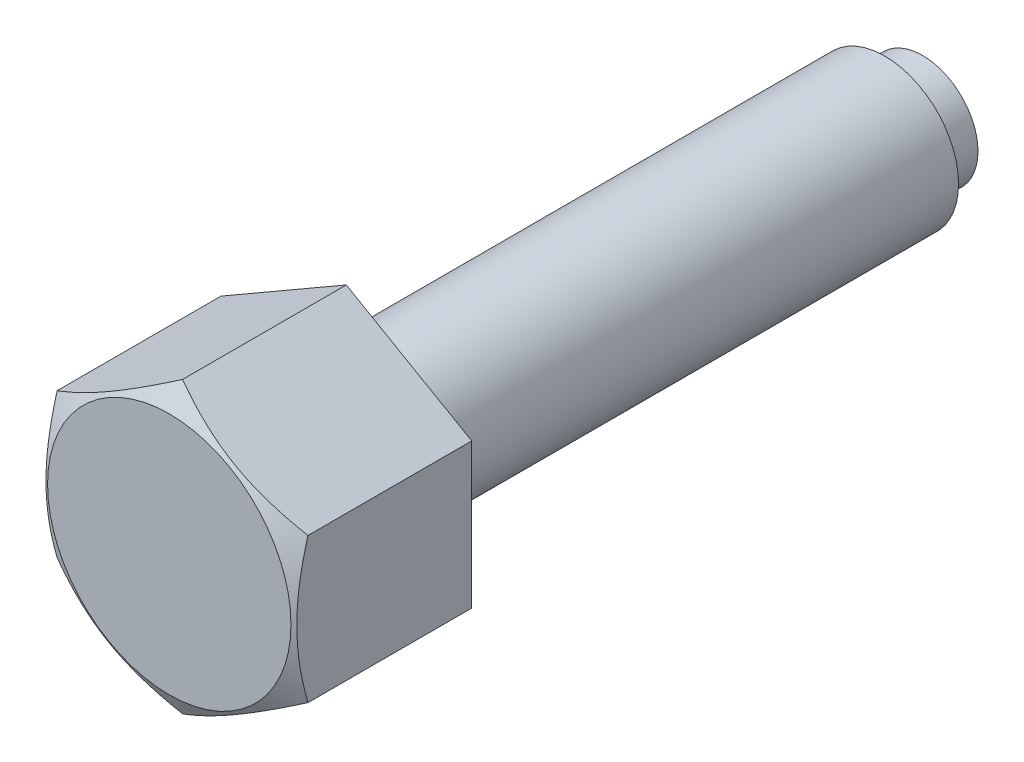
ISO-10303-21;
HEADER;
FILE_DESCRIPTION(('STEP AP214'),'2;1');
FILE_NAME('part.step','',(''),(''),'','','');
FILE_SCHEMA(('AUTOMOTIVE_DESIGN { 1 0 10303 214 1 1 1 1 }'));
ENDSEC;
DATA;
#1=APPLICATION_CONTEXT('core data for automotive mechanical design processes');
#2=APPLICATION_PROTOCOL_DEFINITION('international standard','automotive_design',2000,#1);
#3=PRODUCT_CONTEXT('',#1,'mechanical');
#4=PRODUCT('Part','Part','',(#3));
#5=PRODUCT_RELATED_PRODUCT_CATEGORY('part','',(#4));
#6=PRODUCT_DEFINITION_FORMATION('','',#4);
#7=PRODUCT_DEFINITION_CONTEXT('part definition',#1,'design');
#8=PRODUCT_DEFINITION('design','',#6,#7);
#9=PRODUCT_DEFINITION_SHAPE('','',#8);
#10=(LENGTH_UNIT() NAMED_UNIT(*) SI_UNIT(.MILLI.,.METRE.));
#11=(NAMED_UNIT(*) PLANE_ANGLE_UNIT() SI_UNIT($,.RADIAN.));
#12=(NAMED_UNIT(*) SI_UNIT($,.STERADIAN.) SOLID_ANGLE_UNIT());
#13=UNCERTAINTY_MEASURE_WITH_UNIT(LENGTH_MEASURE(1.E-05),#10,'distance_accuracy_value','');
#14=(GEOMETRIC_REPRESENTATION_CONTEXT(3) GLOBAL_UNCERTAINTY_ASSIGNED_CONTEXT((#13)) GLOBAL_UNIT_ASSIGNED_CONTEXT((#10,
#11,#12)) REPRESENTATION_CONTEXT('',''));
#15=CARTESIAN_POINT('',(0.,0.,0.));
#16=DIRECTION('',(0.,0.,1.));
#17=DIRECTION('',(1.,0.,0.));
#18=AXIS2_PLACEMENT_3D('',#15,#16,#17);
#19=CARTESIAN_POINT('',(0.,9.81495457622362,38.));
#20=DIRECTION('',(-0.5,-0.86602540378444,0.));
#21=DIRECTION('',(0.86602540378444,-0.5,0.));
#22=AXIS2_PLACEMENT_3D('',#19,#20,#21);
#23=PLANE('',#22);
#24=CARTESIAN_POINT('',(8.5002,4.90736181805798,51.0964063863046));
#25=CARTESIAN_POINT('',(8.31336077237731,5.01523349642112,51.1586762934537));
#26=CARTESIAN_POINT('',(8.1258249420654,5.1235073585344,51.2181201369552));
#27=CARTESIAN_POINT('',(7.74923024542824,5.34093440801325,51.3305773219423));
#28=CARTESIAN_POINT('',(7.56017075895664,5.45008795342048,51.3835878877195));
#29=CARTESIAN_POINT('',(6.98996524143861,5.77929626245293,51.5319290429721));
#30=CARTESIAN_POINT('',(6.60656835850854,6.00065055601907,51.6163035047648));
#31=CARTESIAN_POINT('',(6.03282233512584,6.33190297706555,51.7152424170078));
#32=CARTESIAN_POINT('',(5.84418723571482,6.44081150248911,51.7434272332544));
#33=CARTESIAN_POINT('',(5.46606397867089,6.65912106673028,51.7906883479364));
#34=CARTESIAN_POINT('',(5.27657589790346,6.76852206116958,51.8097654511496));
#35=CARTESIAN_POINT('',(4.8972734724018,6.98751241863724,51.8383276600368));
#36=CARTESIAN_POINT('',(4.70745974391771,7.09710142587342,51.8478236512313));
#37=CARTESIAN_POINT('',(4.32765694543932,7.31638067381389,51.8570200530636));
#38=CARTESIAN_POINT('',(4.13766788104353,7.42607091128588,51.8567207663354));
#39=CARTESIAN_POINT('',(3.78247698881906,7.63114046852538,51.8470079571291));
#40=CARTESIAN_POINT('',(3.61725009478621,7.72653426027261,51.838779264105));
#41=CARTESIAN_POINT('',(3.28718328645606,7.91709842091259,51.8150731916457));
#42=CARTESIAN_POINT('',(3.12234339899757,8.01226877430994,51.7995953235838));
#43=CARTESIAN_POINT('',(2.6284618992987,8.29741139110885,51.742653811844));
#44=CARTESIAN_POINT('',(2.3002944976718,8.4868789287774,51.690689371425));
#45=CARTESIAN_POINT('',(1.64047857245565,8.86782383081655,51.5607774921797));
#46=CARTESIAN_POINT('',(1.30891425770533,9.05925257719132,51.4822793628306));
#47=CARTESIAN_POINT('',(0.650730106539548,9.43925537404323,51.30412109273));
#48=CARTESIAN_POINT('',(0.324101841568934,9.62783429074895,51.2045027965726));
#49=CARTESIAN_POINT('',(-0.000199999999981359,9.81507004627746,51.0964063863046));
#50=B_SPLINE_CURVE_WITH_KNOTS('',3,(#24,#25,#26,#27,#28,#29,#30,#31,#32,#33,#34,#35,#36,#37,#38,
#39,#40,#41,#42,#43,#44,#45,#46,#47,#48,#49),.UNSPECIFIED.,.F.,.F.,(4,2,2,2,2,2,2,2,2,2,2,2,4),
(0.,0.673596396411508,1.34748239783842,2.69805431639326,3.356799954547,4.01548737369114,
4.67342558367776,5.33134346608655,5.90409556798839,6.47688628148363,7.62328361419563,
8.79510569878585,9.96462743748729),.UNSPECIFIED.);
#51=CARTESIAN_POINT('',(8.5,4.90747728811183,51.0964730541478));
#52=VERTEX_POINT('',#51);
#53=CARTESIAN_POINT('',(0.,9.81495457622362,51.0964730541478));
#54=VERTEX_POINT('',#53);
#55=EDGE_CURVE('E29',#52,#54,#50,.T.);
#56=ORIENTED_EDGE('',*,*,#55,.F.);
#57=DIRECTION('',(0.,0.,1.));
#58=VECTOR('',#57,1.);
#59=CARTESIAN_POINT('',(8.5,4.90747728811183,38.));
#60=LINE('',#59,#58);
#61=CARTESIAN_POINT('',(8.5,4.90747728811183,40.));
#62=VERTEX_POINT('',#61);
#63=EDGE_CURVE('E96',#62,#52,#60,.T.);
#64=ORIENTED_EDGE('',*,*,#63,.F.);
#65=DIRECTION('',(0.86602540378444,-0.5,0.));
#66=VECTOR('',#65,1.);
#67=CARTESIAN_POINT('',(8.,5.19615242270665,40.));
#68=LINE('',#67,#66);
#69=CARTESIAN_POINT('',(0.,9.81495457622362,40.));
#70=VERTEX_POINT('',#69);
#71=EDGE_CURVE('E110',#70,#62,#68,.T.);
#72=ORIENTED_EDGE('',*,*,#71,.F.);
#73=DIRECTION('',(0.,0.,1.));
#74=VECTOR('',#73,1.);
#75=CARTESIAN_POINT('',(0.,9.81495457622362,38.));
#76=LINE('',#75,#74);
#77=EDGE_CURVE('E36',#70,#54,#76,.T.);
#78=ORIENTED_EDGE('',*,*,#77,.T.);
#79=EDGE_LOOP('',(#56,#64,#72,#78));
#80=FACE_BOUND('',#79,.T.);
#81=ADVANCED_FACE('F14',(#80),#23,.F.);
#82=CARTESIAN_POINT('',(8.5,4.90747728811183,38.));
#83=DIRECTION('',(-1.,0.,0.));
#84=DIRECTION('',(0.,0.,1.));
#85=AXIS2_PLACEMENT_3D('',#82,#83,#84);
#86=PLANE('',#85);
#87=CARTESIAN_POINT('',(8.5,-13.1544784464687,47.7208261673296));
#88=CARTESIAN_POINT('',(8.5,-12.7834585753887,47.9006928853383));
#89=CARTESIAN_POINT('',(8.5,-12.4115840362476,48.0788269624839));
#90=CARTESIAN_POINT('',(8.5,-11.6656709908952,48.43065480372));
#91=CARTESIAN_POINT('',(8.5,-11.2916321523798,48.6043478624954));
#92=CARTESIAN_POINT('',(8.5,-10.5389954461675,48.9471983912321));
#93=CARTESIAN_POINT('',(8.5,-10.1603838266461,49.116325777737));
#94=CARTESIAN_POINT('',(8.5,-9.40013962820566,49.4476223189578));
#95=CARTESIAN_POINT('',(8.5,-9.01850719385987,49.6097918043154));
#96=CARTESIAN_POINT('',(8.5,-8.23940170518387,49.9303594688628));
#97=CARTESIAN_POINT('',(8.5,-7.84181104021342,50.088473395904));
#98=CARTESIAN_POINT('',(8.5,-7.04196894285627,50.3926676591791));
#99=CARTESIAN_POINT('',(8.5,-6.6397169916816,50.5387466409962));
#100=CARTESIAN_POINT('',(8.5,-5.83066935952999,50.815015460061));
#101=CARTESIAN_POINT('',(8.5,-5.42388486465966,50.9452377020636));
#102=CARTESIAN_POINT('',(8.5,-4.6044956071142,51.1855979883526));
#103=CARTESIAN_POINT('',(8.5,-4.19189273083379,51.2957423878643));
#104=CARTESIAN_POINT('',(8.5,-3.36284904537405,51.4900511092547));
#105=CARTESIAN_POINT('',(8.5,-2.94644193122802,51.5743553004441));
#106=CARTESIAN_POINT('',(8.5,-2.31806148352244,51.6777679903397));
#107=CARTESIAN_POINT('',(8.5,-2.10795739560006,51.7083996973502));
#108=CARTESIAN_POINT('',(8.5,-1.6867143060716,51.7613804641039));
#109=CARTESIAN_POINT('',(8.5,-1.47557540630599,51.783730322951));
#110=CARTESIAN_POINT('',(8.5,-1.05529169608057,51.8194232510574));
#111=CARTESIAN_POINT('',(8.5,-0.846156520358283,51.8328793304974));
#112=CARTESIAN_POINT('',(8.5,-0.427504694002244,51.8509374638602));
#113=CARTESIAN_POINT('',(8.5,-0.217988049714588,51.8555396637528));
#114=CARTESIAN_POINT('',(8.5,0.201052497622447,51.8557803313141));
#115=CARTESIAN_POINT('',(8.5,0.41057640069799,51.8514187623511));
#116=CARTESIAN_POINT('',(8.5,0.829254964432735,51.8338380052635));
#117=CARTESIAN_POINT('',(8.5,1.03840960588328,51.8206183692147));
#118=CARTESIAN_POINT('',(8.5,1.54191247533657,51.7784108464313));
#119=CARTESIAN_POINT('',(8.5,1.83591189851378,51.7451734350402));
#120=CARTESIAN_POINT('',(8.5,2.42169667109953,51.6630160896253));
#121=CARTESIAN_POINT('',(8.5,2.71348171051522,51.6140939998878));
#122=CARTESIAN_POINT('',(8.5,3.5851997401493,51.4463975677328));
#123=CARTESIAN_POINT('',(8.5,4.16116375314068,51.3067245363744));
#124=CARTESIAN_POINT('',(8.5,5.02234408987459,51.0649201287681));
#125=CARTESIAN_POINT('',(8.5,5.3120374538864,50.9778200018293));
#126=CARTESIAN_POINT('',(8.5,5.88860978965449,50.794672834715));
#127=CARTESIAN_POINT('',(8.5,6.17548874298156,50.6986257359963));
#128=CARTESIAN_POINT('',(8.5,6.74652438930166,50.4991173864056));
#129=CARTESIAN_POINT('',(8.5,7.03068196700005,50.3956586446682));
#130=CARTESIAN_POINT('',(8.5,7.59664953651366,50.1825343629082));
#131=CARTESIAN_POINT('',(8.5,7.87845955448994,50.0728688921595));
#132=CARTESIAN_POINT('',(8.5,8.5380549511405,49.8091578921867));
#133=CARTESIAN_POINT('',(8.5,8.9149893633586,49.6529879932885));
#134=CARTESIAN_POINT('',(8.5,9.66569875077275,49.3332092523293));
#135=CARTESIAN_POINT('',(8.5,10.0394735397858,49.1695999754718));
#136=CARTESIAN_POINT('',(8.5,10.7844451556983,48.8364175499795));
#137=CARTESIAN_POINT('',(8.5,11.1556414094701,48.6668431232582));
#138=CARTESIAN_POINT('',(8.5,11.8958014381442,48.3229209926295));
#139=CARTESIAN_POINT('',(8.5,12.2647652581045,48.1485733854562));
#140=CARTESIAN_POINT('',(8.5,13.0012184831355,47.7958031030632));
#141=CARTESIAN_POINT('',(8.5,13.3687059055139,47.6173762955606));
#142=CARTESIAN_POINT('',(8.5,14.1021061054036,47.2573123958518));
#143=CARTESIAN_POINT('',(8.5,14.4680188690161,47.0756752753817));
#144=CARTESIAN_POINT('',(8.5,15.5636737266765,46.5268414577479));
#145=CARTESIAN_POINT('',(8.5,16.2914277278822,46.1556762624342));
#146=CARTESIAN_POINT('',(8.5,17.6830679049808,45.4368731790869));
#147=CARTESIAN_POINT('',(8.5,18.3472608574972,45.0898265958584));
#148=CARTESIAN_POINT('',(8.5,19.6731720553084,44.390986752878));
#149=CARTESIAN_POINT('',(8.5,20.3348902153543,44.0391933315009));
#150=CARTESIAN_POINT('',(8.5,21.6547822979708,43.3328474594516));
#151=CARTESIAN_POINT('',(8.5,22.3129609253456,42.9783037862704));
#152=CARTESIAN_POINT('',(8.5,23.6277327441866,42.2663718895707));
#153=CARTESIAN_POINT('',(8.5,24.2843260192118,41.9089838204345));
#154=CARTESIAN_POINT('',(8.5,24.9403342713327,41.5505323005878));
#155=B_SPLINE_CURVE_WITH_KNOTS('',3,(#87,#88,#89,#90,#91,#92,#93,#94,#95,#96,#97,#98,#99,#100,
#101,#102,#103,#104,#105,#106,#107,#108,#109,#110,#111,#112,#113,#114,#115,#116,#117,#118,#119,
#120,#121,#122,#123,#124,#125,#126,#127,#128,#129,#130,#131,#132,#133,#134,#135,#136,#137,#138,
#139,#140,#141,#142,#143,#144,#145,#146,#147,#148,#149,#150,#151,#152,#153,#154),.UNSPECIFIED.,
.F.,.F.,(4,2,2,2,2,2,2,2,2,2,2,2,2,2,2,2,2,2,2,2,2,2,2,2,2,2,2,2,2,2,2,2,2,4),(0.,
1.23697523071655,2.47414571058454,3.71809825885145,4.96199162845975,6.24547014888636,
7.52909291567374,8.81004681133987,10.09059454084,11.3640831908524,12.0009215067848,
12.6376983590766,13.2662198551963,13.8947309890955,14.5232446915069,15.1517901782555,
16.0389050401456,16.9261418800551,18.7016112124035,19.609048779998,20.5164922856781,
21.423630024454,22.3307576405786,23.554667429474,24.7786488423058,26.0028941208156,
27.2271146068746,28.4526356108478,29.678167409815,32.1289134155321,34.3770794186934,
36.6253221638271,38.8681038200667,41.1107645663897),.UNSPECIFIED.);
#156=CARTESIAN_POINT('',(8.5,-4.90747728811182,51.0964730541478));
#157=VERTEX_POINT('',#156);
#158=EDGE_CURVE('E156',#157,#52,#155,.T.);
#159=ORIENTED_EDGE('',*,*,#158,.F.);
#160=DIRECTION('',(0.,0.,1.));
#161=VECTOR('',#160,1.);
#162=CARTESIAN_POINT('',(8.5,-4.90747728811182,38.));
#163=LINE('',#162,#161);
#164=CARTESIAN_POINT('',(8.5,-4.90747728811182,40.));
#165=VERTEX_POINT('',#164);
#166=EDGE_CURVE('E93',#165,#157,#163,.T.);
#167=ORIENTED_EDGE('',*,*,#166,.F.);
#168=DIRECTION('',(0.,-1.,0.));
#169=VECTOR('',#168,1.);
#170=CARTESIAN_POINT('',(8.5,0.,40.));
#171=LINE('',#170,#169);
#172=EDGE_CURVE('E107',#62,#165,#171,.T.);
#173=ORIENTED_EDGE('',*,*,#172,.F.);
#174=ORIENTED_EDGE('',*,*,#63,.T.);
#175=EDGE_LOOP('',(#159,#167,#173,#174));
#176=FACE_BOUND('',#175,.T.);
#177=ADVANCED_FACE('F136',(#176),#86,.F.);
#178=CARTESIAN_POINT('',(0.,-9.81495457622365,38.));
#179=DIRECTION('',(0.5,-0.866025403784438,0.));
#180=DIRECTION('',(0.866025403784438,0.5,0.));
#181=AXIS2_PLACEMENT_3D('',#178,#179,#180);
#182=PLANE('',#181);
#183=ORIENTED_EDGE('',*,*,#166,.T.);
#184=CARTESIAN_POINT('',(8.5002,-4.90736181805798,51.0964063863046));
#185=CARTESIAN_POINT('',(8.31336077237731,-5.01523349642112,51.1586762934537));
#186=CARTESIAN_POINT('',(8.1258249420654,-5.1235073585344,51.2181201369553));
#187=CARTESIAN_POINT('',(7.74923024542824,-5.34093440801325,51.3305773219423));
#188=CARTESIAN_POINT('',(7.56017075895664,-5.45008795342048,51.3835878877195));
#189=CARTESIAN_POINT('',(6.98996524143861,-5.77929626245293,51.5319290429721));
#190=CARTESIAN_POINT('',(6.60656835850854,-6.00065055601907,51.6163035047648));
#191=CARTESIAN_POINT('',(6.03282233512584,-6.33190297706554,51.7152424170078));
#192=CARTESIAN_POINT('',(5.84418723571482,-6.44081150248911,51.7434272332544));
#193=CARTESIAN_POINT('',(5.46606397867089,-6.65912106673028,51.7906883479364));
#194=CARTESIAN_POINT('',(5.27657589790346,-6.76852206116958,51.8097654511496));
#195=CARTESIAN_POINT('',(4.8972734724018,-6.98751241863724,51.8383276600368));
#196=CARTESIAN_POINT('',(4.70745974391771,-7.09710142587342,51.8478236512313));
#197=CARTESIAN_POINT('',(4.32765694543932,-7.31638067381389,51.8570200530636));
#198=CARTESIAN_POINT('',(4.13766788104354,-7.42607091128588,51.8567207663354));
#199=CARTESIAN_POINT('',(3.78247698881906,-7.63114046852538,51.8470079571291));
#200=CARTESIAN_POINT('',(3.61725009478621,-7.72653426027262,51.838779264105));
#201=CARTESIAN_POINT('',(3.28718328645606,-7.91709842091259,51.8150731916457));
#202=CARTESIAN_POINT('',(3.12234339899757,-8.01226877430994,51.7995953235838));
#203=CARTESIAN_POINT('',(2.62846189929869,-8.29741139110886,51.742653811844));
#204=CARTESIAN_POINT('',(2.30029449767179,-8.48687892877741,51.690689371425));
#205=CARTESIAN_POINT('',(1.64047857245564,-8.86782383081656,51.5607774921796));
#206=CARTESIAN_POINT('',(1.30891425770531,-9.05925257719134,51.4822793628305));
#207=CARTESIAN_POINT('',(0.65073010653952,-9.43925537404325,51.30412109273));
#208=CARTESIAN_POINT('',(0.324101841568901,-9.62783429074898,51.2045027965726));
#209=CARTESIAN_POINT('',(-0.000200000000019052,-9.81507004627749,51.0964063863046));
#210=B_SPLINE_CURVE_WITH_KNOTS('',3,(#184,#185,#186,#187,#188,#189,#190,#191,#192,#193,#194,
#195,#196,#197,#198,#199,#200,#201,#202,#203,#204,#205,#206,#207,#208,#209),.UNSPECIFIED.,.F.,
.F.,(4,2,2,2,2,2,2,2,2,2,2,2,4),(0.,0.67359639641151,1.34748239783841,2.69805431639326,
3.356799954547,4.01548737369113,4.67342558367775,5.33134346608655,5.90409556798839,
6.47688628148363,7.62328361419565,8.79510569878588,9.96462743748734),.UNSPECIFIED.);
#211=CARTESIAN_POINT('',(0.,-9.81495457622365,51.0964730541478));
#212=VERTEX_POINT('',#211);
#213=EDGE_CURVE('E162',#157,#212,#210,.T.);
#214=ORIENTED_EDGE('',*,*,#213,.T.);
#215=DIRECTION('',(0.,0.,1.));
#216=VECTOR('',#215,1.);
#217=CARTESIAN_POINT('',(0.,-9.81495457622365,38.));
#218=LINE('',#217,#216);
#219=CARTESIAN_POINT('',(0.,-9.81495457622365,40.));
#220=VERTEX_POINT('',#219);
#221=EDGE_CURVE('E86',#220,#212,#218,.T.);
#222=ORIENTED_EDGE('',*,*,#221,.F.);
#223=DIRECTION('',(0.866025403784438,0.5,0.));
#224=VECTOR('',#223,1.);
#225=CARTESIAN_POINT('',(8.,-5.19615242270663,40.));
#226=LINE('',#225,#224);
#227=EDGE_CURVE('E105',#220,#165,#226,.T.);
#228=ORIENTED_EDGE('',*,*,#227,.T.);
#229=EDGE_LOOP('',(#183,#214,#222,#228));
#230=FACE_BOUND('',#229,.T.);
#231=ADVANCED_FACE('F142',(#230),#182,.T.);
#232=CARTESIAN_POINT('',(0.,-9.81495457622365,38.));
#233=DIRECTION('',(0.5,0.866025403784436,0.));
#234=DIRECTION('',(-0.866025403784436,0.5,0.));
#235=AXIS2_PLACEMENT_3D('',#232,#233,#234);
#236=PLANE('',#235);
#237=CARTESIAN_POINT('',(-8.5002,-4.90736181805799,51.0964063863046));
#238=CARTESIAN_POINT('',(-8.31336077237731,-5.01523349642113,51.1586762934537));
#239=CARTESIAN_POINT('',(-8.12582494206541,-5.12350735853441,51.2181201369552));
#240=CARTESIAN_POINT('',(-7.74923024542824,-5.34093440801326,51.3305773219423));
#241=CARTESIAN_POINT('',(-7.56017075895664,-5.4500879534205,51.3835878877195));
#242=CARTESIAN_POINT('',(-6.98996524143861,-5.77929626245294,51.5319290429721));
#243=CARTESIAN_POINT('',(-6.60656835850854,-6.00065055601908,51.6163035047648));
#244=CARTESIAN_POINT('',(-6.03282233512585,-6.33190297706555,51.7152424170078));
#245=CARTESIAN_POINT('',(-5.84418723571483,-6.44081150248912,51.7434272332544));
#246=CARTESIAN_POINT('',(-5.4660639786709,-6.65912106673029,51.7906883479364));
#247=CARTESIAN_POINT('',(-5.27657589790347,-6.76852206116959,51.8097654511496));
#248=CARTESIAN_POINT('',(-4.89727347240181,-6.98751241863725,51.8383276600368));
#249=CARTESIAN_POINT('',(-4.70745974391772,-7.09710142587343,51.8478236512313));
#250=CARTESIAN_POINT('',(-4.32765694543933,-7.3163806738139,51.8570200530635));
#251=CARTESIAN_POINT('',(-4.13766788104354,-7.4260709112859,51.8567207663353));
#252=CARTESIAN_POINT('',(-3.78247698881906,-7.6311404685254,51.847007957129));
#253=CARTESIAN_POINT('',(-3.61725009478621,-7.72653426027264,51.838779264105));
#254=CARTESIAN_POINT('',(-3.28718328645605,-7.91709842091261,51.8150731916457));
#255=CARTESIAN_POINT('',(-3.12234339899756,-8.01226877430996,51.7995953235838));
#256=CARTESIAN_POINT('',(-2.6284618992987,-8.29741139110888,51.7426538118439));
#257=CARTESIAN_POINT('',(-2.3002944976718,-8.48687892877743,51.690689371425));
#258=CARTESIAN_POINT('',(-1.64047857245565,-8.86782383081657,51.5607774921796));
#259=CARTESIAN_POINT('',(-1.30891425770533,-9.05925257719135,51.4822793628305));
#260=CARTESIAN_POINT('',(-0.650730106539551,-9.43925537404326,51.30412109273));
#261=CARTESIAN_POINT('',(-0.324101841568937,-9.62783429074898,51.2045027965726));
#262=CARTESIAN_POINT('',(0.000199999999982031,-9.81507004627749,51.0964063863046));
#263=B_SPLINE_CURVE_WITH_KNOTS('',3,(#237,#238,#239,#240,#241,#242,#243,#244,#245,#246,#247,
#248,#249,#250,#251,#252,#253,#254,#255,#256,#257,#258,#259,#260,#261,#262),.UNSPECIFIED.,.F.,
.F.,(4,2,2,2,2,2,2,2,2,2,2,2,4),(0.,0.673596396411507,1.34748239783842,2.69805431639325,
3.35679995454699,4.01548737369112,4.67342558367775,5.33134346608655,5.90409556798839,
6.47688628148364,7.62328361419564,8.79510569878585,9.96462743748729),.UNSPECIFIED.);
#264=CARTESIAN_POINT('',(-8.5,-4.90747728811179,51.0964730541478));
#265=VERTEX_POINT('',#264);
#266=EDGE_CURVE('E80',#265,#212,#263,.T.);
#267=ORIENTED_EDGE('',*,*,#266,.F.);
#268=DIRECTION('',(0.,0.,1.));
#269=VECTOR('',#268,1.);
#270=CARTESIAN_POINT('',(-8.5,-4.90747728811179,38.));
#271=LINE('',#270,#269);
#272=CARTESIAN_POINT('',(-8.5,-4.90747728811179,40.));
#273=VERTEX_POINT('',#272);
#274=EDGE_CURVE('E79',#273,#265,#271,.T.);
#275=ORIENTED_EDGE('',*,*,#274,.F.);
#276=DIRECTION('',(-0.866025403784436,0.5,0.));
#277=VECTOR('',#276,1.);
#278=CARTESIAN_POINT('',(-0.500000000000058,-9.52627944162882,40.));
#279=LINE('',#278,#277);
#280=EDGE_CURVE('E102',#220,#273,#279,.T.);
#281=ORIENTED_EDGE('',*,*,#280,.F.);
#282=ORIENTED_EDGE('',*,*,#221,.T.);
#283=EDGE_LOOP('',(#267,#275,#281,#282));
#284=FACE_BOUND('',#283,.T.);
#285=ADVANCED_FACE('F238',(#284),#236,.F.);
#286=CARTESIAN_POINT('',(-8.5,4.90747728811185,38.));
#287=DIRECTION('',(-1.,0.,0.));
#288=DIRECTION('',(0.,-1.,0.));
#289=AXIS2_PLACEMENT_3D('',#286,#287,#288);
#290=PLANE('',#289);
#291=ORIENTED_EDGE('',*,*,#274,.T.);
#292=CARTESIAN_POINT('',(-8.5,-13.1544784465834,47.720826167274));
#293=CARTESIAN_POINT('',(-8.5,-12.7834585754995,47.900692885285));
#294=CARTESIAN_POINT('',(-8.5,-12.4115840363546,48.078826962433));
#295=CARTESIAN_POINT('',(-8.5,-11.6656709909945,48.4306548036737));
#296=CARTESIAN_POINT('',(-8.5,-11.2916321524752,48.6043478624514));
#297=CARTESIAN_POINT('',(-8.5,-10.5389954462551,48.9471983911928));
#298=CARTESIAN_POINT('',(-8.5,-10.1603838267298,49.1163257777));
#299=CARTESIAN_POINT('',(-8.5,-9.40013962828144,49.4476223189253));
#300=CARTESIAN_POINT('',(-8.5,-9.0185071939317,49.6097918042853));
#301=CARTESIAN_POINT('',(-8.5,-8.2394017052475,49.9303594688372));
#302=CARTESIAN_POINT('',(-8.5,-7.8418110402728,50.0884733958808));
#303=CARTESIAN_POINT('',(-8.5,-7.04196894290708,50.3926676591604));
#304=CARTESIAN_POINT('',(-8.5,-6.63971699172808,50.5387466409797));
#305=CARTESIAN_POINT('',(-8.5,-5.83066935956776,50.8150154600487));
#306=CARTESIAN_POINT('',(-8.5,-5.42388486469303,50.9452377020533));
#307=CARTESIAN_POINT('',(-8.5,-4.60449560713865,51.1855979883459));
#308=CARTESIAN_POINT('',(-8.5,-4.19189273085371,51.2957423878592));
#309=CARTESIAN_POINT('',(-8.5,-3.36284904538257,51.490051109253));
#310=CARTESIAN_POINT('',(-8.5,-2.94644193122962,51.574355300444));
#311=CARTESIAN_POINT('',(-8.5,-2.31806148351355,51.6777679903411));
#312=CARTESIAN_POINT('',(-8.5,-2.10795739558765,51.7083996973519));
#313=CARTESIAN_POINT('',(-8.5,-1.68671430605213,51.7613804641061));
#314=CARTESIAN_POINT('',(-8.5,-1.47557540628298,51.7837303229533));
#315=CARTESIAN_POINT('',(-8.5,-1.05529169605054,51.8194232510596));
#316=CARTESIAN_POINT('',(-8.5,-0.846156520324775,51.8328793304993));
#317=CARTESIAN_POINT('',(-8.5,-0.427504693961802,51.8509374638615));
#318=CARTESIAN_POINT('',(-8.5,-0.217988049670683,51.8555396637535));
#319=CARTESIAN_POINT('',(-8.5,0.201052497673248,51.8557803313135));
#320=CARTESIAN_POINT('',(-8.5,0.410576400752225,51.8514187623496));
#321=CARTESIAN_POINT('',(-8.5,0.829254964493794,51.8338380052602));
#322=CARTESIAN_POINT('',(-8.5,1.03840960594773,51.8206183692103));
#323=CARTESIAN_POINT('',(-8.5,1.54191247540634,51.7784108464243));
#324=CARTESIAN_POINT('',(-8.5,1.83591189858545,51.7451734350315));
#325=CARTESIAN_POINT('',(-8.5,2.42169667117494,51.6630160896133));
#326=CARTESIAN_POINT('',(-8.5,2.71348171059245,51.6140939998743));
#327=CARTESIAN_POINT('',(-8.5,3.58519974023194,51.4463975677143));
#328=CARTESIAN_POINT('',(-8.5,4.16116375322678,51.3067245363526));
#329=CARTESIAN_POINT('',(-8.5,5.02234408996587,51.0649201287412));
#330=CARTESIAN_POINT('',(-8.5,5.31203745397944,50.9778200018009));
#331=CARTESIAN_POINT('',(-8.5,5.88860978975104,50.7946728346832));
#332=CARTESIAN_POINT('',(-8.5,6.17548874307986,50.698625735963));
#333=CARTESIAN_POINT('',(-8.5,6.74652438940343,50.499117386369));
#334=CARTESIAN_POINT('',(-8.5,7.03068196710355,50.3956586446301));
#335=CARTESIAN_POINT('',(-8.5,7.59664953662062,50.1825343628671));
#336=CARTESIAN_POINT('',(-8.5,7.87845955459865,50.0728688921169));
#337=CARTESIAN_POINT('',(-8.5,8.53805495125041,49.8091578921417));
#338=CARTESIAN_POINT('',(-8.5,8.91498936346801,49.6529879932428));
#339=CARTESIAN_POINT('',(-8.5,9.66569875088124,49.3332092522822));
#340=CARTESIAN_POINT('',(-8.5,10.0394735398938,49.1695999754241));
#341=CARTESIAN_POINT('',(-8.5,10.7844451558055,48.8364175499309));
#342=CARTESIAN_POINT('',(-8.5,11.155641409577,48.6668431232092));
#343=CARTESIAN_POINT('',(-8.5,11.8958014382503,48.3229209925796));
#344=CARTESIAN_POINT('',(-8.5,12.2647652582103,48.148573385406));
#345=CARTESIAN_POINT('',(-8.5,13.0012184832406,47.7958031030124));
#346=CARTESIAN_POINT('',(-8.5,13.3687059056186,47.6173762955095));
#347=CARTESIAN_POINT('',(-8.5,14.1021061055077,47.2573123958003));
#348=CARTESIAN_POINT('',(-8.5,14.4680188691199,47.07567527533));
#349=CARTESIAN_POINT('',(-8.5,15.5636737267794,46.5268414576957));
#350=CARTESIAN_POINT('',(-8.5,16.2914277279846,46.1556762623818));
#351=CARTESIAN_POINT('',(-8.5,17.6830679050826,45.4368731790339));
#352=CARTESIAN_POINT('',(-8.5,18.3472608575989,45.0898265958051));
#353=CARTESIAN_POINT('',(-8.5,19.67317205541,44.3909867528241));
#354=CARTESIAN_POINT('',(-8.5,20.3348902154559,44.0391933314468));
#355=CARTESIAN_POINT('',(-8.5,21.6547822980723,43.3328474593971));
#356=CARTESIAN_POINT('',(-8.5,22.3129609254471,42.9783037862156));
#357=CARTESIAN_POINT('',(-8.5,23.6277327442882,42.2663718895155));
#358=CARTESIAN_POINT('',(-8.5,24.2843260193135,41.9089838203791));
#359=CARTESIAN_POINT('',(-8.5,24.9403342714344,41.5505323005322));
#360=B_SPLINE_CURVE_WITH_KNOTS('',3,(#292,#293,#294,#295,#296,#297,#298,#299,#300,#301,#302,
#303,#304,#305,#306,#307,#308,#309,#310,#311,#312,#313,#314,#315,#316,#317,#318,#319,#320,#321,
#322,#323,#324,#325,#326,#327,#328,#329,#330,#331,#332,#333,#334,#335,#336,#337,#338,#339,#340,
#341,#342,#343,#344,#345,#346,#347,#348,#349,#350,#351,#352,#353,#354,#355,#356,#357,#358,#359),
.UNSPECIFIED.,.F.,.F.,(4,2,2,2,2,2,2,2,2,2,2,2,2,2,2,2,2,2,2,2,2,2,2,2,2,2,2,2,2,2,2,2,2,4),(0.,
1.23697523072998,2.47414571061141,3.71809825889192,4.96199162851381,6.24547014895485,
7.52909291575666,8.81004681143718,10.0905945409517,11.3640831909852,12.0009215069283,
12.6376983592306,13.2662198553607,13.8947309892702,14.523244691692,15.1517901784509,
16.0389050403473,16.926141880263,18.7016112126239,19.6090487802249,20.5164922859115,
21.4236300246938,22.3307576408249,23.5546674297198,24.7786488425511,26.0028941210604,
27.2271146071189,28.4526356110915,29.6781674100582,32.1289134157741,34.3770794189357,
36.6253221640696,38.8681038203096,41.110764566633),.UNSPECIFIED.);
#361=CARTESIAN_POINT('',(-8.5,4.90747728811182,51.0964730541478));
#362=VERTEX_POINT('',#361);
#363=EDGE_CURVE('E67',#265,#362,#360,.T.);
#364=ORIENTED_EDGE('',*,*,#363,.T.);
#365=DIRECTION('',(0.,0.,1.));
#366=VECTOR('',#365,1.);
#367=CARTESIAN_POINT('',(-8.5,4.90747728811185,38.));
#368=LINE('',#367,#366);
#369=CARTESIAN_POINT('',(-8.5,4.90747728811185,40.));
#370=VERTEX_POINT('',#369);
#371=EDGE_CURVE('E76',#370,#362,#368,.T.);
#372=ORIENTED_EDGE('',*,*,#371,.F.);
#373=DIRECTION('',(0.,-1.,0.));
#374=VECTOR('',#373,1.);
#375=CARTESIAN_POINT('',(-8.5,0.,40.));
#376=LINE('',#375,#374);
#377=EDGE_CURVE('E100',#370,#273,#376,.T.);
#378=ORIENTED_EDGE('',*,*,#377,.T.);
#379=EDGE_LOOP('',(#291,#364,#372,#378));
#380=FACE_BOUND('',#379,.T.);
#381=ADVANCED_FACE('F75',(#380),#290,.T.);
#382=CARTESIAN_POINT('',(0.,9.81495457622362,38.));
#383=DIRECTION('',(-0.5,0.866025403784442,0.));
#384=DIRECTION('',(-0.866025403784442,-0.5,0.));
#385=AXIS2_PLACEMENT_3D('',#382,#383,#384);
#386=PLANE('',#385);
#387=ORIENTED_EDGE('',*,*,#371,.T.);
#388=CARTESIAN_POINT('',(-8.5002,4.90736181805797,51.0964063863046));
#389=CARTESIAN_POINT('',(-8.31336077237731,5.01523349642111,51.1586762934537));
#390=CARTESIAN_POINT('',(-8.12582494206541,5.12350735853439,51.2181201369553));
#391=CARTESIAN_POINT('',(-7.74923024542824,5.34093440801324,51.3305773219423));
#392=CARTESIAN_POINT('',(-7.56017075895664,5.45008795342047,51.3835878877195));
#393=CARTESIAN_POINT('',(-6.98996524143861,5.77929626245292,51.5319290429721));
#394=CARTESIAN_POINT('',(-6.60656835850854,6.00065055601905,51.6163035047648));
#395=CARTESIAN_POINT('',(-6.03282233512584,6.33190297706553,51.7152424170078));
#396=CARTESIAN_POINT('',(-5.84418723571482,6.4408115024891,51.7434272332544));
#397=CARTESIAN_POINT('',(-5.4660639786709,6.65912106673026,51.7906883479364));
#398=CARTESIAN_POINT('',(-5.27657589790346,6.76852206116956,51.8097654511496));
#399=CARTESIAN_POINT('',(-4.89727347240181,6.98751241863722,51.8383276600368));
#400=CARTESIAN_POINT('',(-4.70745974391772,7.0971014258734,51.8478236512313));
#401=CARTESIAN_POINT('',(-4.32765694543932,7.31638067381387,51.8570200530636));
#402=CARTESIAN_POINT('',(-4.13766788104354,7.42607091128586,51.8567207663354));
#403=CARTESIAN_POINT('',(-3.78247698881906,7.63114046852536,51.8470079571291));
#404=CARTESIAN_POINT('',(-3.61725009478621,7.7265342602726,51.838779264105));
#405=CARTESIAN_POINT('',(-3.28718328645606,7.91709842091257,51.8150731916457));
#406=CARTESIAN_POINT('',(-3.12234339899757,8.01226877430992,51.7995953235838));
#407=CARTESIAN_POINT('',(-2.62846189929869,8.29741139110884,51.742653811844));
#408=CARTESIAN_POINT('',(-2.30029449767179,8.48687892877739,51.690689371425));
#409=CARTESIAN_POINT('',(-1.64047857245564,8.86782383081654,51.5607774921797));
#410=CARTESIAN_POINT('',(-1.30891425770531,9.05925257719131,51.4822793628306));
#411=CARTESIAN_POINT('',(-0.65073010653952,9.43925537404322,51.30412109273));
#412=CARTESIAN_POINT('',(-0.324101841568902,9.62783429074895,51.2045027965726));
#413=CARTESIAN_POINT('',(0.000200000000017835,9.81507004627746,51.0964063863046));
#414=B_SPLINE_CURVE_WITH_KNOTS('',3,(#388,#389,#390,#391,#392,#393,#394,#395,#396,#397,#398,
#399,#400,#401,#402,#403,#404,#405,#406,#407,#408,#409,#410,#411,#412,#413),.UNSPECIFIED.,.F.,
.F.,(4,2,2,2,2,2,2,2,2,2,2,2,4),(0.,0.673596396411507,1.34748239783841,2.69805431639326,
3.356799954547,4.01548737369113,4.67342558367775,5.33134346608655,5.90409556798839,
6.47688628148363,7.62328361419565,8.79510569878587,9.96462743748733),.UNSPECIFIED.);
#415=EDGE_CURVE('E64',#362,#54,#414,.T.);
#416=ORIENTED_EDGE('',*,*,#415,.T.);
#417=ORIENTED_EDGE('',*,*,#77,.F.);
#418=DIRECTION('',(-0.866025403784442,-0.5,0.));
#419=VECTOR('',#418,1.);
#420=CARTESIAN_POINT('',(-0.499999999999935,9.52627944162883,40.));
#421=LINE('',#420,#419);
#422=EDGE_CURVE('E84',#70,#370,#421,.T.);
#423=ORIENTED_EDGE('',*,*,#422,.T.);
#424=EDGE_LOOP('',(#387,#416,#417,#423));
#425=FACE_BOUND('',#424,.T.);
#426=ADVANCED_FACE('F82',(#425),#386,.T.);
#427=CARTESIAN_POINT('',(0.,0.,8.));
#428=DIRECTION('',(0.,0.,1.));
#429=DIRECTION('',(1.,0.,0.));
#430=AXIS2_PLACEMENT_3D('',#427,#428,#429);
#431=SPHERICAL_SURFACE('',#430,8.);
#432=CARTESIAN_POINT('',(0.,0.,0.933352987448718));
#433=DIRECTION('',(0.,0.,1.));
#434=DIRECTION('',(1.,0.,0.));
#435=AXIS2_PLACEMENT_3D('',#432,#433,#434);
#436=CIRCLE('',#435,3.75);
#437=CARTESIAN_POINT('',(3.75,0.,0.933352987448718));
#438=VERTEX_POINT('',#437);
#439=EDGE_CURVE('E9',#438,#438,#436,.T.);
#440=ORIENTED_EDGE('',*,*,#439,.F.);
#441=EDGE_LOOP('',(#440));
#442=FACE_BOUND('',#441,.T.);
#443=ADVANCED_FACE('F16',(#442),#431,.T.);
#444=CARTESIAN_POINT('',(0.,0.,110.));
#445=DIRECTION('',(0.,0.,1.));
#446=DIRECTION('',(1.,0.,0.));
#447=AXIS2_PLACEMENT_3D('',#444,#445,#446);
#448=CYLINDRICAL_SURFACE('',#447,3.75);
#449=ORIENTED_EDGE('',*,*,#439,.T.);
#450=EDGE_LOOP('',(#449));
#451=FACE_BOUND('',#450,.T.);
#452=CARTESIAN_POINT('',(0.,0.,3.5));
#453=DIRECTION('',(0.,0.,1.));
#454=DIRECTION('',(1.,0.,0.));
#455=AXIS2_PLACEMENT_3D('',#452,#453,#454);
#456=CIRCLE('',#455,3.75);
#457=CARTESIAN_POINT('',(3.75,0.,3.5));
#458=VERTEX_POINT('',#457);
#459=EDGE_CURVE('E22',#458,#458,#456,.T.);
#460=ORIENTED_EDGE('',*,*,#459,.F.);
#461=EDGE_LOOP('',(#460));
#462=FACE_BOUND('',#461,.T.);
#463=ADVANCED_FACE('F123',(#451,#462),#448,.T.);
#464=CARTESIAN_POINT('',(3.75,0.,3.5));
#465=DIRECTION('',(0.,0.,1.));
#466=DIRECTION('',(1.,0.,0.));
#467=AXIS2_PLACEMENT_3D('',#464,#465,#466);
#468=PLANE('',#467);
#469=CARTESIAN_POINT('',(0.,0.,3.5));
#470=DIRECTION('',(0.,0.,1.));
#471=DIRECTION('',(1.,0.,0.));
#472=AXIS2_PLACEMENT_3D('',#469,#470,#471);
#473=CIRCLE('',#472,5.);
#474=CARTESIAN_POINT('',(5.,0.,3.5));
#475=VERTEX_POINT('',#474);
#476=EDGE_CURVE('E116',#475,#475,#473,.T.);
#477=ORIENTED_EDGE('',*,*,#476,.F.);
#478=EDGE_LOOP('',(#477));
#479=FACE_BOUND('',#478,.T.);
#480=ORIENTED_EDGE('',*,*,#459,.T.);
#481=EDGE_LOOP('',(#480));
#482=FACE_BOUND('',#481,.T.);
#483=ADVANCED_FACE('F121',(#479,#482),#468,.F.);
#484=CARTESIAN_POINT('',(0.,0.,110.));
#485=DIRECTION('',(0.,0.,1.));
#486=DIRECTION('',(1.,0.,0.));
#487=AXIS2_PLACEMENT_3D('',#484,#485,#486);
#488=CYLINDRICAL_SURFACE('',#487,5.);
#489=CARTESIAN_POINT('',(0.,0.,40.));
#490=DIRECTION('',(0.,0.,1.));
#491=DIRECTION('',(1.,0.,0.));
#492=AXIS2_PLACEMENT_3D('',#489,#490,#491);
#493=CIRCLE('',#492,5.);
#494=CARTESIAN_POINT('',(5.,0.,40.));
#495=VERTEX_POINT('',#494);
#496=EDGE_CURVE('E113',#495,#495,#493,.T.);
#497=ORIENTED_EDGE('',*,*,#496,.F.);
#498=EDGE_LOOP('',(#497));
#499=FACE_BOUND('',#498,.T.);
#500=ORIENTED_EDGE('',*,*,#476,.T.);
#501=EDGE_LOOP('',(#500));
#502=FACE_BOUND('',#501,.T.);
#503=ADVANCED_FACE('F131',(#499,#502),#488,.T.);
#504=CARTESIAN_POINT('',(5.,0.,40.));
#505=DIRECTION('',(0.,0.,1.));
#506=DIRECTION('',(1.,0.,0.));
#507=AXIS2_PLACEMENT_3D('',#504,#505,#506);
#508=PLANE('',#507);
#509=ORIENTED_EDGE('',*,*,#422,.F.);
#510=ORIENTED_EDGE('',*,*,#71,.T.);
#511=ORIENTED_EDGE('',*,*,#172,.T.);
#512=ORIENTED_EDGE('',*,*,#227,.F.);
#513=ORIENTED_EDGE('',*,*,#280,.T.);
#514=ORIENTED_EDGE('',*,*,#377,.F.);
#515=EDGE_LOOP('',(#509,#510,#511,#512,#513,#514));
#516=FACE_BOUND('',#515,.T.);
#517=ORIENTED_EDGE('',*,*,#496,.T.);
#518=EDGE_LOOP('',(#517));
#519=FACE_BOUND('',#518,.T.);
#520=ADVANCED_FACE('F177',(#516,#519),#508,.F.);
#521=CARTESIAN_POINT('',(0.,0.,52.));
#522=DIRECTION('',(0.,0.,-1.));
#523=DIRECTION('',(-1.,0.,0.));
#524=AXIS2_PLACEMENT_3D('',#521,#522,#523);
#525=CONICAL_SURFACE('',#524,8.25,1.0471975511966);
#526=CARTESIAN_POINT('',(0.,0.,52.));
#527=DIRECTION('',(0.,0.,1.));
#528=DIRECTION('',(1.,0.,0.));
#529=AXIS2_PLACEMENT_3D('',#526,#527,#528);
#530=CIRCLE('',#529,8.25);
#531=CARTESIAN_POINT('',(8.25,0.,52.));
#532=VERTEX_POINT('',#531);
#533=EDGE_CURVE('E70',#532,#532,#530,.T.);
#534=ORIENTED_EDGE('',*,*,#533,.F.);
#535=EDGE_LOOP('',(#534));
#536=FACE_BOUND('',#535,.T.);
#537=ORIENTED_EDGE('',*,*,#55,.T.);
#538=ORIENTED_EDGE('',*,*,#415,.F.);
#539=ORIENTED_EDGE('',*,*,#363,.F.);
#540=ORIENTED_EDGE('',*,*,#266,.T.);
#541=ORIENTED_EDGE('',*,*,#213,.F.);
#542=ORIENTED_EDGE('',*,*,#158,.T.);
#543=EDGE_LOOP('',(#537,#538,#539,#540,#541,#542));
#544=FACE_BOUND('',#543,.T.);
#545=ADVANCED_FACE('F66',(#536,#544),#525,.T.);
#546=CARTESIAN_POINT('',(0.,0.,52.));
#547=DIRECTION('',(0.,0.,1.));
#548=DIRECTION('',(1.,0.,0.));
#549=AXIS2_PLACEMENT_3D('',#546,#547,#548);
#550=PLANE('',#549);
#551=ORIENTED_EDGE('',*,*,#533,.T.);
#552=EDGE_LOOP('',(#551));
#553=FACE_BOUND('',#552,.T.);
#554=ADVANCED_FACE('F173',(#553),#550,.T.);
#555=CLOSED_SHELL('',(#81,#177,#231,#285,#381,#426,#443,#463,#483,#503,#520,#545,#554));
#556=MANIFOLD_SOLID_BREP('B1',#555);
#557=ADVANCED_BREP_SHAPE_REPRESENTATION('',(#18,#556),#14);
#558=SHAPE_DEFINITION_REPRESENTATION(#9,#557);
ENDSEC;
END-ISO-10303-21;
